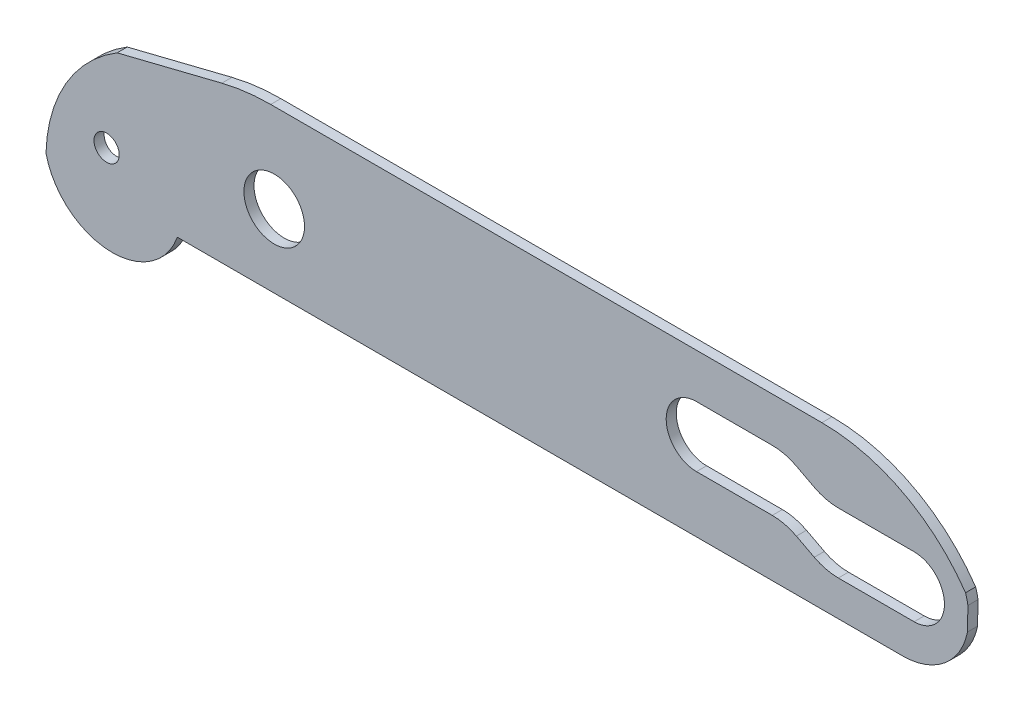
ISO-10303-21;
HEADER;
FILE_DESCRIPTION(('STEP AP214'),'2;1');
FILE_NAME('part.step','',(''),(''),'','','');
FILE_SCHEMA(('AUTOMOTIVE_DESIGN { 1 0 10303 214 1 1 1 1 }'));
ENDSEC;
DATA;
#1=APPLICATION_CONTEXT('core data for automotive mechanical design processes');
#2=APPLICATION_PROTOCOL_DEFINITION('international standard','automotive_design',2000,#1);
#3=PRODUCT_CONTEXT('',#1,'mechanical');
#4=PRODUCT('Part','Part','',(#3));
#5=PRODUCT_RELATED_PRODUCT_CATEGORY('part','',(#4));
#6=PRODUCT_DEFINITION_FORMATION('','',#4);
#7=PRODUCT_DEFINITION_CONTEXT('part definition',#1,'design');
#8=PRODUCT_DEFINITION('design','',#6,#7);
#9=PRODUCT_DEFINITION_SHAPE('','',#8);
#10=(LENGTH_UNIT() NAMED_UNIT(*) SI_UNIT(.MILLI.,.METRE.));
#11=(NAMED_UNIT(*) PLANE_ANGLE_UNIT() SI_UNIT($,.RADIAN.));
#12=(NAMED_UNIT(*) SI_UNIT($,.STERADIAN.) SOLID_ANGLE_UNIT());
#13=UNCERTAINTY_MEASURE_WITH_UNIT(LENGTH_MEASURE(1.E-05),#10,'distance_accuracy_value','');
#14=(GEOMETRIC_REPRESENTATION_CONTEXT(3) GLOBAL_UNCERTAINTY_ASSIGNED_CONTEXT((#13)) GLOBAL_UNIT_ASSIGNED_CONTEXT((#10,
#11,#12)) REPRESENTATION_CONTEXT('',''));
#15=CARTESIAN_POINT('',(0.,0.,0.));
#16=DIRECTION('',(0.,0.,1.));
#17=DIRECTION('',(1.,0.,0.));
#18=AXIS2_PLACEMENT_3D('',#15,#16,#17);
#19=CARTESIAN_POINT('',(-6.44003693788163,2.30657377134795,1.));
#20=DIRECTION('',(0.,0.,-1.));
#21=DIRECTION('',(-1.,0.,0.));
#22=AXIS2_PLACEMENT_3D('',#19,#20,#21);
#23=PLANE('',#22);
#24=DIRECTION('',(-1.,0.,0.));
#25=VECTOR('',#24,1.);
#26=CARTESIAN_POINT('',(72.9112737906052,9.5,1.));
#27=LINE('',#26,#25);
#28=CARTESIAN_POINT('',(72.9112737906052,9.5,1.));
#29=VERTEX_POINT('',#28);
#30=CARTESIAN_POINT('',(65.4112737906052,9.5,1.));
#31=VERTEX_POINT('',#30);
#32=EDGE_CURVE('E514',#29,#31,#27,.T.);
#33=ORIENTED_EDGE('',*,*,#32,.F.);
#34=CARTESIAN_POINT('',(72.9112737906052,6.5,1.));
#35=DIRECTION('',(0.,0.,1.));
#36=DIRECTION('',(-1.,0.,0.));
#37=AXIS2_PLACEMENT_3D('',#34,#35,#36);
#38=CIRCLE('',#37,3.);
#39=CARTESIAN_POINT('',(72.9112737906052,3.5,1.));
#40=VERTEX_POINT('',#39);
#41=EDGE_CURVE('E363',#40,#29,#38,.T.);
#42=ORIENTED_EDGE('',*,*,#41,.F.);
#43=DIRECTION('',(1.,0.,0.));
#44=VECTOR('',#43,1.);
#45=CARTESIAN_POINT('',(72.9112737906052,3.5,1.));
#46=LINE('',#45,#44);
#47=CARTESIAN_POINT('',(65.4112737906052,3.5,1.));
#48=VERTEX_POINT('',#47);
#49=EDGE_CURVE('E547',#48,#40,#46,.T.);
#50=ORIENTED_EDGE('',*,*,#49,.F.);
#51=CARTESIAN_POINT('',(65.4112737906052,8.64,1.));
#52=DIRECTION('',(0.,0.,1.));
#53=DIRECTION('',(-1.,0.,0.));
#54=AXIS2_PLACEMENT_3D('',#51,#52,#53);
#55=CIRCLE('',#54,5.14);
#56=CARTESIAN_POINT('',(63.0280034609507,4.08592242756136,1.));
#57=VERTEX_POINT('',#56);
#58=EDGE_CURVE('E544',#57,#48,#55,.T.);
#59=ORIENTED_EDGE('',*,*,#58,.F.);
#60=DIRECTION('',(0.886007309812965,-0.463671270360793,0.));
#61=VECTOR('',#60,1.);
#62=CARTESIAN_POINT('',(61.2559888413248,5.01326496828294,1.));
#63=LINE('',#62,#61);
#64=CARTESIAN_POINT('',(61.2559888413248,5.01326496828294,1.));
#65=VERTEX_POINT('',#64);
#66=EDGE_CURVE('E541',#65,#57,#63,.T.);
#67=ORIENTED_EDGE('',*,*,#66,.F.);
#68=CARTESIAN_POINT('',(58.8727185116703,0.459187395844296,1.));
#69=DIRECTION('',(0.,0.,-1.));
#70=DIRECTION('',(-1.,0.,0.));
#71=AXIS2_PLACEMENT_3D('',#68,#69,#70);
#72=CIRCLE('',#71,5.14);
#73=CARTESIAN_POINT('',(58.8727185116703,5.5991873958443,1.));
#74=VERTEX_POINT('',#73);
#75=EDGE_CURVE('E538',#74,#65,#72,.T.);
#76=ORIENTED_EDGE('',*,*,#75,.F.);
#77=DIRECTION('',(1.,0.,0.));
#78=VECTOR('',#77,1.);
#79=CARTESIAN_POINT('',(51.3727185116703,5.5991873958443,1.));
#80=LINE('',#79,#78);
#81=CARTESIAN_POINT('',(51.3727185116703,5.5991873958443,1.));
#82=VERTEX_POINT('',#81);
#83=EDGE_CURVE('E535',#82,#74,#80,.T.);
#84=ORIENTED_EDGE('',*,*,#83,.F.);
#85=CARTESIAN_POINT('',(51.3727185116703,8.5991873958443,1.));
#86=DIRECTION('',(0.,0.,1.));
#87=DIRECTION('',(-1.,0.,0.));
#88=AXIS2_PLACEMENT_3D('',#85,#86,#87);
#89=CIRCLE('',#88,3.);
#90=CARTESIAN_POINT('',(51.3727185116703,11.5991873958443,1.));
#91=VERTEX_POINT('',#90);
#92=EDGE_CURVE('E532',#91,#82,#89,.T.);
#93=ORIENTED_EDGE('',*,*,#92,.F.);
#94=DIRECTION('',(-1.,0.,0.));
#95=VECTOR('',#94,1.);
#96=CARTESIAN_POINT('',(58.8727185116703,11.5991873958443,1.));
#97=LINE('',#96,#95);
#98=CARTESIAN_POINT('',(58.8727185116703,11.5991873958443,1.));
#99=VERTEX_POINT('',#98);
#100=EDGE_CURVE('E529',#99,#91,#97,.T.);
#101=ORIENTED_EDGE('',*,*,#100,.F.);
#102=CARTESIAN_POINT('',(58.8727185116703,6.4591873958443,1.));
#103=DIRECTION('',(0.,0.,1.));
#104=DIRECTION('',(-1.,0.,0.));
#105=AXIS2_PLACEMENT_3D('',#102,#103,#104);
#106=CIRCLE('',#105,5.14);
#107=CARTESIAN_POINT('',(61.2559888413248,11.0132649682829,1.));
#108=VERTEX_POINT('',#107);
#109=EDGE_CURVE('E523',#108,#99,#106,.T.);
#110=ORIENTED_EDGE('',*,*,#109,.F.);
#111=DIRECTION('',(-0.886007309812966,0.463671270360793,0.));
#112=VECTOR('',#111,1.);
#113=CARTESIAN_POINT('',(61.2559888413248,11.0132649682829,1.));
#114=LINE('',#113,#112);
#115=CARTESIAN_POINT('',(63.0280034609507,10.0859224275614,1.));
#116=VERTEX_POINT('',#115);
#117=EDGE_CURVE('E521',#116,#108,#114,.T.);
#118=ORIENTED_EDGE('',*,*,#117,.F.);
#119=CARTESIAN_POINT('',(65.4112737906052,14.64,1.));
#120=DIRECTION('',(0.,0.,-1.));
#121=DIRECTION('',(1.,0.,0.));
#122=AXIS2_PLACEMENT_3D('',#119,#120,#121);
#123=CIRCLE('',#122,5.14);
#124=EDGE_CURVE('E505',#31,#116,#123,.T.);
#125=ORIENTED_EDGE('',*,*,#124,.F.);
#126=EDGE_LOOP('',(#33,#42,#50,#59,#67,#76,#84,#93,#101,#110,#118,#125));
#127=FACE_BOUND('',#126,.T.);
#128=CARTESIAN_POINT('',(9.58381950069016,7.21,1.));
#129=DIRECTION('',(0.,0.,1.));
#130=DIRECTION('',(1.,0.,0.));
#131=AXIS2_PLACEMENT_3D('',#128,#129,#130);
#132=CIRCLE('',#131,3.);
#133=CARTESIAN_POINT('',(12.5838195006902,7.21,1.));
#134=VERTEX_POINT('',#133);
#135=EDGE_CURVE('E612',#134,#134,#132,.T.);
#136=ORIENTED_EDGE('',*,*,#135,.F.);
#137=EDGE_LOOP('',(#136));
#138=FACE_BOUND('',#137,.T.);
#139=CARTESIAN_POINT('',(-6.44003693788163,2.30657377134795,1.));
#140=DIRECTION('',(0.,0.,1.));
#141=DIRECTION('',(-1.,0.,0.));
#142=AXIS2_PLACEMENT_3D('',#139,#140,#141);
#143=CIRCLE('',#142,6.84064019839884);
#144=CARTESIAN_POINT('',(-7.30705508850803,-4.47889878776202,1.));
#145=VERTEX_POINT('',#144);
#146=CARTESIAN_POINT('',(0.,0.,1.));
#147=VERTEX_POINT('',#146);
#148=EDGE_CURVE('E638',#145,#147,#143,.T.);
#149=ORIENTED_EDGE('',*,*,#148,.T.);
#150=DIRECTION('',(1.,0.,0.));
#151=VECTOR('',#150,1.);
#152=CARTESIAN_POINT('',(0.,0.,1.));
#153=LINE('',#152,#151);
#154=CARTESIAN_POINT('',(71.7838195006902,0.,1.));
#155=VERTEX_POINT('',#154);
#156=EDGE_CURVE('E641',#147,#155,#153,.T.);
#157=ORIENTED_EDGE('',*,*,#156,.T.);
#158=CARTESIAN_POINT('',(71.7838195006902,6.53,1.));
#159=DIRECTION('',(0.,0.,1.));
#160=DIRECTION('',(1.,0.,0.));
#161=AXIS2_PLACEMENT_3D('',#158,#159,#160);
#162=CIRCLE('',#161,6.53);
#163=CARTESIAN_POINT('',(78.1890777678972,5.25973761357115,1.));
#164=VERTEX_POINT('',#163);
#165=EDGE_CURVE('E643',#155,#164,#162,.T.);
#166=ORIENTED_EDGE('',*,*,#165,.T.);
#167=DIRECTION('',(0.0186351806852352,0.999826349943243,0.));
#168=VECTOR('',#167,1.);
#169=CARTESIAN_POINT('',(78.2319639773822,7.56069530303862,1.));
#170=LINE('',#169,#168);
#171=CARTESIAN_POINT('',(78.2319639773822,7.56069530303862,1.));
#172=VERTEX_POINT('',#171);
#173=EDGE_CURVE('E645',#164,#172,#170,.T.);
#174=ORIENTED_EDGE('',*,*,#173,.T.);
#175=CARTESIAN_POINT('',(71.7838195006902,6.53,1.));
#176=DIRECTION('',(0.,0.,1.));
#177=DIRECTION('',(1.,0.,0.));
#178=AXIS2_PLACEMENT_3D('',#175,#176,#177);
#179=CIRCLE('',#178,6.53);
#180=CARTESIAN_POINT('',(78.,8.53,1.));
#181=VERTEX_POINT('',#180);
#182=EDGE_CURVE('E647',#172,#181,#179,.T.);
#183=ORIENTED_EDGE('',*,*,#182,.T.);
#184=CARTESIAN_POINT('',(63.7838195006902,-1.26242891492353,1.));
#185=DIRECTION('',(0.,0.,1.));
#186=DIRECTION('',(-1.,0.,0.));
#187=AXIS2_PLACEMENT_3D('',#184,#185,#186);
#188=CIRCLE('',#187,17.2624289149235);
#189=CARTESIAN_POINT('',(63.7838195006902,16.,1.));
#190=VERTEX_POINT('',#189);
#191=EDGE_CURVE('E649',#181,#190,#188,.T.);
#192=ORIENTED_EDGE('',*,*,#191,.T.);
#193=DIRECTION('',(-1.,0.,0.));
#194=VECTOR('',#193,1.);
#195=CARTESIAN_POINT('',(9.23951071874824,16.,1.));
#196=LINE('',#195,#194);
#197=CARTESIAN_POINT('',(9.23951071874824,16.,1.));
#198=VERTEX_POINT('',#197);
#199=EDGE_CURVE('E651',#190,#198,#196,.T.);
#200=ORIENTED_EDGE('',*,*,#199,.T.);
#201=CARTESIAN_POINT('',(9.23951071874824,-4.,1.));
#202=DIRECTION('',(0.,0.,1.));
#203=DIRECTION('',(1.,0.,0.));
#204=AXIS2_PLACEMENT_3D('',#201,#202,#203);
#205=CIRCLE('',#204,20.);
#206=CARTESIAN_POINT('',(4.40107280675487,15.4059145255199,1.));
#207=VERTEX_POINT('',#206);
#208=EDGE_CURVE('E653',#198,#207,#205,.T.);
#209=ORIENTED_EDGE('',*,*,#208,.T.);
#210=DIRECTION('',(-0.970295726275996,-0.241921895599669,0.));
#211=VECTOR('',#210,1.);
#212=CARTESIAN_POINT('',(4.40107280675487,15.4059145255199,1.));
#213=LINE('',#212,#211);
#214=CARTESIAN_POINT('',(-5.95954577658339,12.8227221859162,1.));
#215=VERTEX_POINT('',#214);
#216=EDGE_CURVE('E655',#207,#215,#213,.T.);
#217=ORIENTED_EDGE('',*,*,#216,.T.);
#218=CARTESIAN_POINT('',(1.58074264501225,0.337599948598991,1.));
#219=DIRECTION('',(0.,0.,1.));
#220=DIRECTION('',(-1.,0.,0.));
#221=AXIS2_PLACEMENT_3D('',#218,#219,#220);
#222=CIRCLE('',#221,14.5854114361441);
#223=CARTESIAN_POINT('',(-13.,0.706613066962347,1.));
#224=VERTEX_POINT('',#223);
#225=EDGE_CURVE('E657',#215,#224,#222,.T.);
#226=ORIENTED_EDGE('',*,*,#225,.T.);
#227=CARTESIAN_POINT('',(-6.45725345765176,2.17183354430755,1.));
#228=DIRECTION('',(0.,0.,1.));
#229=DIRECTION('',(-1.,0.,0.));
#230=AXIS2_PLACEMENT_3D('',#227,#228,#229);
#231=CIRCLE('',#230,6.70480449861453);
#232=EDGE_CURVE('E659',#224,#145,#231,.T.);
#233=ORIENTED_EDGE('',*,*,#232,.T.);
#234=EDGE_LOOP('',(#149,#157,#166,#174,#183,#192,#200,#209,#217,#226,#233));
#235=FACE_BOUND('',#234,.T.);
#236=CARTESIAN_POINT('',(-7.,4.17,1.));
#237=DIRECTION('',(0.,0.,1.));
#238=DIRECTION('',(1.,0.,0.));
#239=AXIS2_PLACEMENT_3D('',#236,#237,#238);
#240=CIRCLE('',#239,1.25);
#241=CARTESIAN_POINT('',(-5.75,4.17,1.));
#242=VERTEX_POINT('',#241);
#243=EDGE_CURVE('E606',#242,#242,#240,.T.);
#244=ORIENTED_EDGE('',*,*,#243,.F.);
#245=EDGE_LOOP('',(#244));
#246=FACE_BOUND('',#245,.T.);
#247=ADVANCED_FACE('F348',(#127,#138,#235,#246),#23,.F.);
#248=CARTESIAN_POINT('',(-6.44003693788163,2.30657377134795,0.));
#249=DIRECTION('',(0.,0.,-1.));
#250=DIRECTION('',(-1.,0.,0.));
#251=AXIS2_PLACEMENT_3D('',#248,#249,#250);
#252=PLANE('',#251);
#253=CARTESIAN_POINT('',(72.9112737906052,6.5,0.));
#254=DIRECTION('',(0.,0.,1.));
#255=DIRECTION('',(-1.,0.,0.));
#256=AXIS2_PLACEMENT_3D('',#253,#254,#255);
#257=CIRCLE('',#256,3.);
#258=CARTESIAN_POINT('',(72.9112737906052,3.5,0.));
#259=VERTEX_POINT('',#258);
#260=CARTESIAN_POINT('',(72.9112737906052,9.5,0.));
#261=VERTEX_POINT('',#260);
#262=EDGE_CURVE('E550',#259,#261,#257,.T.);
#263=ORIENTED_EDGE('',*,*,#262,.T.);
#264=DIRECTION('',(-1.,0.,0.));
#265=VECTOR('',#264,1.);
#266=CARTESIAN_POINT('',(72.9112737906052,9.5,0.));
#267=LINE('',#266,#265);
#268=CARTESIAN_POINT('',(65.4112737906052,9.5,0.));
#269=VERTEX_POINT('',#268);
#270=EDGE_CURVE('E553',#261,#269,#267,.T.);
#271=ORIENTED_EDGE('',*,*,#270,.T.);
#272=CARTESIAN_POINT('',(65.4112737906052,14.64,0.));
#273=DIRECTION('',(0.,0.,-1.));
#274=DIRECTION('',(1.,0.,0.));
#275=AXIS2_PLACEMENT_3D('',#272,#273,#274);
#276=CIRCLE('',#275,5.14);
#277=CARTESIAN_POINT('',(63.0280034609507,10.0859224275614,0.));
#278=VERTEX_POINT('',#277);
#279=EDGE_CURVE('E371',#269,#278,#276,.T.);
#280=ORIENTED_EDGE('',*,*,#279,.T.);
#281=DIRECTION('',(-0.886007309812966,0.463671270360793,0.));
#282=VECTOR('',#281,1.);
#283=CARTESIAN_POINT('',(61.2559888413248,11.0132649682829,0.));
#284=LINE('',#283,#282);
#285=CARTESIAN_POINT('',(61.2559888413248,11.0132649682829,0.));
#286=VERTEX_POINT('',#285);
#287=EDGE_CURVE('E556',#278,#286,#284,.T.);
#288=ORIENTED_EDGE('',*,*,#287,.T.);
#289=CARTESIAN_POINT('',(58.8727185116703,6.4591873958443,0.));
#290=DIRECTION('',(0.,0.,1.));
#291=DIRECTION('',(-1.,0.,0.));
#292=AXIS2_PLACEMENT_3D('',#289,#290,#291);
#293=CIRCLE('',#292,5.14);
#294=CARTESIAN_POINT('',(58.8727185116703,11.5991873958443,0.));
#295=VERTEX_POINT('',#294);
#296=EDGE_CURVE('E559',#286,#295,#293,.T.);
#297=ORIENTED_EDGE('',*,*,#296,.T.);
#298=DIRECTION('',(-1.,0.,0.));
#299=VECTOR('',#298,1.);
#300=CARTESIAN_POINT('',(58.8727185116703,11.5991873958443,0.));
#301=LINE('',#300,#299);
#302=CARTESIAN_POINT('',(51.3727185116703,11.5991873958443,0.));
#303=VERTEX_POINT('',#302);
#304=EDGE_CURVE('E562',#295,#303,#301,.T.);
#305=ORIENTED_EDGE('',*,*,#304,.T.);
#306=CARTESIAN_POINT('',(51.3727185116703,8.5991873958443,0.));
#307=DIRECTION('',(0.,0.,1.));
#308=DIRECTION('',(-1.,0.,0.));
#309=AXIS2_PLACEMENT_3D('',#306,#307,#308);
#310=CIRCLE('',#309,3.);
#311=CARTESIAN_POINT('',(51.3727185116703,5.5991873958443,0.));
#312=VERTEX_POINT('',#311);
#313=EDGE_CURVE('E565',#303,#312,#310,.T.);
#314=ORIENTED_EDGE('',*,*,#313,.T.);
#315=DIRECTION('',(1.,0.,0.));
#316=VECTOR('',#315,1.);
#317=CARTESIAN_POINT('',(51.3727185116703,5.5991873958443,0.));
#318=LINE('',#317,#316);
#319=CARTESIAN_POINT('',(58.8727185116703,5.5991873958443,0.));
#320=VERTEX_POINT('',#319);
#321=EDGE_CURVE('E568',#312,#320,#318,.T.);
#322=ORIENTED_EDGE('',*,*,#321,.T.);
#323=CARTESIAN_POINT('',(58.8727185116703,0.459187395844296,0.));
#324=DIRECTION('',(0.,0.,-1.));
#325=DIRECTION('',(-1.,0.,0.));
#326=AXIS2_PLACEMENT_3D('',#323,#324,#325);
#327=CIRCLE('',#326,5.14);
#328=CARTESIAN_POINT('',(61.2559888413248,5.01326496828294,0.));
#329=VERTEX_POINT('',#328);
#330=EDGE_CURVE('E571',#320,#329,#327,.T.);
#331=ORIENTED_EDGE('',*,*,#330,.T.);
#332=DIRECTION('',(0.886007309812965,-0.463671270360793,0.));
#333=VECTOR('',#332,1.);
#334=CARTESIAN_POINT('',(61.2559888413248,5.01326496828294,0.));
#335=LINE('',#334,#333);
#336=CARTESIAN_POINT('',(63.0280034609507,4.08592242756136,0.));
#337=VERTEX_POINT('',#336);
#338=EDGE_CURVE('E574',#329,#337,#335,.T.);
#339=ORIENTED_EDGE('',*,*,#338,.T.);
#340=CARTESIAN_POINT('',(65.4112737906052,8.64,0.));
#341=DIRECTION('',(0.,0.,1.));
#342=DIRECTION('',(-1.,0.,0.));
#343=AXIS2_PLACEMENT_3D('',#340,#341,#342);
#344=CIRCLE('',#343,5.14);
#345=CARTESIAN_POINT('',(65.4112737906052,3.5,0.));
#346=VERTEX_POINT('',#345);
#347=EDGE_CURVE('E577',#337,#346,#344,.T.);
#348=ORIENTED_EDGE('',*,*,#347,.T.);
#349=DIRECTION('',(1.,0.,0.));
#350=VECTOR('',#349,1.);
#351=CARTESIAN_POINT('',(72.9112737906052,3.5,0.));
#352=LINE('',#351,#350);
#353=EDGE_CURVE('E580',#346,#259,#352,.T.);
#354=ORIENTED_EDGE('',*,*,#353,.T.);
#355=EDGE_LOOP('',(#263,#271,#280,#288,#297,#305,#314,#322,#331,#339,#348,#354));
#356=FACE_BOUND('',#355,.T.);
#357=CARTESIAN_POINT('',(9.58381950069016,7.21,0.));
#358=DIRECTION('',(0.,0.,1.));
#359=DIRECTION('',(1.,0.,0.));
#360=AXIS2_PLACEMENT_3D('',#357,#358,#359);
#361=CIRCLE('',#360,3.);
#362=CARTESIAN_POINT('',(12.5838195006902,7.21,0.));
#363=VERTEX_POINT('',#362);
#364=EDGE_CURVE('E609',#363,#363,#361,.T.);
#365=ORIENTED_EDGE('',*,*,#364,.T.);
#366=EDGE_LOOP('',(#365));
#367=FACE_BOUND('',#366,.T.);
#368=CARTESIAN_POINT('',(-6.44003693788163,2.30657377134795,0.));
#369=DIRECTION('',(0.,0.,1.));
#370=DIRECTION('',(-1.,0.,0.));
#371=AXIS2_PLACEMENT_3D('',#368,#369,#370);
#372=CIRCLE('',#371,6.84064019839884);
#373=CARTESIAN_POINT('',(-7.30705508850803,-4.47889878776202,0.));
#374=VERTEX_POINT('',#373);
#375=CARTESIAN_POINT('',(0.,0.,0.));
#376=VERTEX_POINT('',#375);
#377=EDGE_CURVE('E615',#374,#376,#372,.T.);
#378=ORIENTED_EDGE('',*,*,#377,.F.);
#379=CARTESIAN_POINT('',(-6.45725345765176,2.17183354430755,0.));
#380=DIRECTION('',(0.,0.,1.));
#381=DIRECTION('',(-1.,0.,0.));
#382=AXIS2_PLACEMENT_3D('',#379,#380,#381);
#383=CIRCLE('',#382,6.70480449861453);
#384=CARTESIAN_POINT('',(-13.,0.706613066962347,0.));
#385=VERTEX_POINT('',#384);
#386=EDGE_CURVE('E636',#385,#374,#383,.T.);
#387=ORIENTED_EDGE('',*,*,#386,.F.);
#388=CARTESIAN_POINT('',(1.58074264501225,0.337599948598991,0.));
#389=DIRECTION('',(0.,0.,1.));
#390=DIRECTION('',(-1.,0.,0.));
#391=AXIS2_PLACEMENT_3D('',#388,#389,#390);
#392=CIRCLE('',#391,14.5854114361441);
#393=CARTESIAN_POINT('',(-5.95954577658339,12.8227221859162,0.));
#394=VERTEX_POINT('',#393);
#395=EDGE_CURVE('E634',#394,#385,#392,.T.);
#396=ORIENTED_EDGE('',*,*,#395,.F.);
#397=DIRECTION('',(-0.970295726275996,-0.241921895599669,0.));
#398=VECTOR('',#397,1.);
#399=CARTESIAN_POINT('',(4.40107280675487,15.4059145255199,0.));
#400=LINE('',#399,#398);
#401=CARTESIAN_POINT('',(4.40107280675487,15.4059145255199,0.));
#402=VERTEX_POINT('',#401);
#403=EDGE_CURVE('E632',#402,#394,#400,.T.);
#404=ORIENTED_EDGE('',*,*,#403,.F.);
#405=CARTESIAN_POINT('',(9.23951071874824,-4.,0.));
#406=DIRECTION('',(0.,0.,1.));
#407=DIRECTION('',(1.,0.,0.));
#408=AXIS2_PLACEMENT_3D('',#405,#406,#407);
#409=CIRCLE('',#408,20.);
#410=CARTESIAN_POINT('',(9.23951071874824,16.,0.));
#411=VERTEX_POINT('',#410);
#412=EDGE_CURVE('E630',#411,#402,#409,.T.);
#413=ORIENTED_EDGE('',*,*,#412,.F.);
#414=DIRECTION('',(-1.,0.,0.));
#415=VECTOR('',#414,1.);
#416=CARTESIAN_POINT('',(9.23951071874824,16.,0.));
#417=LINE('',#416,#415);
#418=CARTESIAN_POINT('',(63.7838195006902,16.,0.));
#419=VERTEX_POINT('',#418);
#420=EDGE_CURVE('E628',#419,#411,#417,.T.);
#421=ORIENTED_EDGE('',*,*,#420,.F.);
#422=CARTESIAN_POINT('',(63.7838195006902,-1.26242891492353,0.));
#423=DIRECTION('',(0.,0.,1.));
#424=DIRECTION('',(-1.,0.,0.));
#425=AXIS2_PLACEMENT_3D('',#422,#423,#424);
#426=CIRCLE('',#425,17.2624289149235);
#427=CARTESIAN_POINT('',(78.,8.53,0.));
#428=VERTEX_POINT('',#427);
#429=EDGE_CURVE('E626',#428,#419,#426,.T.);
#430=ORIENTED_EDGE('',*,*,#429,.F.);
#431=CARTESIAN_POINT('',(71.7838195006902,6.53,0.));
#432=DIRECTION('',(0.,0.,1.));
#433=DIRECTION('',(1.,0.,0.));
#434=AXIS2_PLACEMENT_3D('',#431,#432,#433);
#435=CIRCLE('',#434,6.53);
#436=CARTESIAN_POINT('',(78.2319639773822,7.56069530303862,0.));
#437=VERTEX_POINT('',#436);
#438=EDGE_CURVE('E624',#437,#428,#435,.T.);
#439=ORIENTED_EDGE('',*,*,#438,.F.);
#440=DIRECTION('',(0.0186351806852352,0.999826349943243,0.));
#441=VECTOR('',#440,1.);
#442=CARTESIAN_POINT('',(78.2319639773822,7.56069530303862,0.));
#443=LINE('',#442,#441);
#444=CARTESIAN_POINT('',(78.1890777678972,5.25973761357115,0.));
#445=VERTEX_POINT('',#444);
#446=EDGE_CURVE('E622',#445,#437,#443,.T.);
#447=ORIENTED_EDGE('',*,*,#446,.F.);
#448=CARTESIAN_POINT('',(71.7838195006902,6.53,0.));
#449=DIRECTION('',(0.,0.,1.));
#450=DIRECTION('',(1.,0.,0.));
#451=AXIS2_PLACEMENT_3D('',#448,#449,#450);
#452=CIRCLE('',#451,6.53);
#453=CARTESIAN_POINT('',(71.7838195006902,0.,0.));
#454=VERTEX_POINT('',#453);
#455=EDGE_CURVE('E620',#454,#445,#452,.T.);
#456=ORIENTED_EDGE('',*,*,#455,.F.);
#457=DIRECTION('',(1.,0.,0.));
#458=VECTOR('',#457,1.);
#459=CARTESIAN_POINT('',(0.,0.,0.));
#460=LINE('',#459,#458);
#461=EDGE_CURVE('E618',#376,#454,#460,.T.);
#462=ORIENTED_EDGE('',*,*,#461,.F.);
#463=EDGE_LOOP('',(#378,#387,#396,#404,#413,#421,#430,#439,#447,#456,#462));
#464=FACE_BOUND('',#463,.T.);
#465=CARTESIAN_POINT('',(-7.,4.17,0.));
#466=DIRECTION('',(0.,0.,1.));
#467=DIRECTION('',(1.,0.,0.));
#468=AXIS2_PLACEMENT_3D('',#465,#466,#467);
#469=CIRCLE('',#468,1.25);
#470=CARTESIAN_POINT('',(-5.75,4.17,0.));
#471=VERTEX_POINT('',#470);
#472=EDGE_CURVE('E585',#471,#471,#469,.T.);
#473=ORIENTED_EDGE('',*,*,#472,.T.);
#474=EDGE_LOOP('',(#473));
#475=FACE_BOUND('',#474,.T.);
#476=ADVANCED_FACE('F698',(#356,#367,#464,#475),#252,.T.);
#477=CARTESIAN_POINT('',(-6.44003693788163,2.30657377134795,1.));
#478=DIRECTION('',(0.,0.,-1.));
#479=DIRECTION('',(-1.,0.,0.));
#480=AXIS2_PLACEMENT_3D('',#477,#478,#479);
#481=CYLINDRICAL_SURFACE('',#480,6.84064019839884);
#482=ORIENTED_EDGE('',*,*,#377,.T.);
#483=DIRECTION('',(0.,0.,-1.));
#484=VECTOR('',#483,1.);
#485=CARTESIAN_POINT('',(0.,0.,1.));
#486=LINE('',#485,#484);
#487=EDGE_CURVE('E11',#147,#376,#486,.T.);
#488=ORIENTED_EDGE('',*,*,#487,.F.);
#489=ORIENTED_EDGE('',*,*,#148,.F.);
#490=DIRECTION('',(0.,0.,-1.));
#491=VECTOR('',#490,1.);
#492=CARTESIAN_POINT('',(-7.30705508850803,-4.47889878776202,1.));
#493=LINE('',#492,#491);
#494=EDGE_CURVE('E661',#145,#374,#493,.T.);
#495=ORIENTED_EDGE('',*,*,#494,.T.);
#496=EDGE_LOOP('',(#482,#488,#489,#495));
#497=FACE_BOUND('',#496,.T.);
#498=ADVANCED_FACE('F350',(#497),#481,.T.);
#499=CARTESIAN_POINT('',(0.,0.,1.));
#500=DIRECTION('',(0.,1.,0.));
#501=DIRECTION('',(0.,0.,1.));
#502=AXIS2_PLACEMENT_3D('',#499,#500,#501);
#503=PLANE('',#502);
#504=ORIENTED_EDGE('',*,*,#461,.T.);
#505=DIRECTION('',(0.,0.,-1.));
#506=VECTOR('',#505,1.);
#507=CARTESIAN_POINT('',(71.7838195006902,0.,1.));
#508=LINE('',#507,#506);
#509=EDGE_CURVE('E356',#155,#454,#508,.T.);
#510=ORIENTED_EDGE('',*,*,#509,.F.);
#511=ORIENTED_EDGE('',*,*,#156,.F.);
#512=ORIENTED_EDGE('',*,*,#487,.T.);
#513=EDGE_LOOP('',(#504,#510,#511,#512));
#514=FACE_BOUND('',#513,.T.);
#515=ADVANCED_FACE('F716',(#514),#503,.F.);
#516=CARTESIAN_POINT('',(71.7838195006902,6.53,1.));
#517=DIRECTION('',(0.,0.,-1.));
#518=DIRECTION('',(-1.,0.,0.));
#519=AXIS2_PLACEMENT_3D('',#516,#517,#518);
#520=CYLINDRICAL_SURFACE('',#519,6.53);
#521=ORIENTED_EDGE('',*,*,#455,.T.);
#522=DIRECTION('',(0.,0.,-1.));
#523=VECTOR('',#522,1.);
#524=CARTESIAN_POINT('',(78.1890777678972,5.25973761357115,1.));
#525=LINE('',#524,#523);
#526=EDGE_CURVE('E685',#164,#445,#525,.T.);
#527=ORIENTED_EDGE('',*,*,#526,.F.);
#528=ORIENTED_EDGE('',*,*,#165,.F.);
#529=ORIENTED_EDGE('',*,*,#509,.T.);
#530=EDGE_LOOP('',(#521,#527,#528,#529));
#531=FACE_BOUND('',#530,.T.);
#532=ADVANCED_FACE('F692',(#531),#520,.T.);
#533=CARTESIAN_POINT('',(78.2319639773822,7.56069530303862,1.));
#534=DIRECTION('',(-0.999826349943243,0.0186351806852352,0.));
#535=DIRECTION('',(-0.0186351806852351,-0.999826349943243,0.));
#536=AXIS2_PLACEMENT_3D('',#533,#534,#535);
#537=PLANE('',#536);
#538=ORIENTED_EDGE('',*,*,#446,.T.);
#539=DIRECTION('',(0.,0.,-1.));
#540=VECTOR('',#539,1.);
#541=CARTESIAN_POINT('',(78.2319639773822,7.56069530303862,1.));
#542=LINE('',#541,#540);
#543=EDGE_CURVE('E682',#172,#437,#542,.T.);
#544=ORIENTED_EDGE('',*,*,#543,.F.);
#545=ORIENTED_EDGE('',*,*,#173,.F.);
#546=ORIENTED_EDGE('',*,*,#526,.T.);
#547=EDGE_LOOP('',(#538,#544,#545,#546));
#548=FACE_BOUND('',#547,.T.);
#549=ADVANCED_FACE('F704',(#548),#537,.F.);
#550=CARTESIAN_POINT('',(71.7838195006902,6.53,1.));
#551=DIRECTION('',(0.,0.,-1.));
#552=DIRECTION('',(-1.,0.,0.));
#553=AXIS2_PLACEMENT_3D('',#550,#551,#552);
#554=CYLINDRICAL_SURFACE('',#553,6.53);
#555=ORIENTED_EDGE('',*,*,#438,.T.);
#556=DIRECTION('',(0.,0.,-1.));
#557=VECTOR('',#556,1.);
#558=CARTESIAN_POINT('',(78.,8.53,1.));
#559=LINE('',#558,#557);
#560=EDGE_CURVE('E679',#181,#428,#559,.T.);
#561=ORIENTED_EDGE('',*,*,#560,.F.);
#562=ORIENTED_EDGE('',*,*,#182,.F.);
#563=ORIENTED_EDGE('',*,*,#543,.T.);
#564=EDGE_LOOP('',(#555,#561,#562,#563));
#565=FACE_BOUND('',#564,.T.);
#566=ADVANCED_FACE('F708',(#565),#554,.T.);
#567=CARTESIAN_POINT('',(63.7838195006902,-1.26242891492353,1.));
#568=DIRECTION('',(0.,0.,-1.));
#569=DIRECTION('',(-1.,0.,0.));
#570=AXIS2_PLACEMENT_3D('',#567,#568,#569);
#571=CYLINDRICAL_SURFACE('',#570,17.2624289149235);
#572=ORIENTED_EDGE('',*,*,#429,.T.);
#573=DIRECTION('',(0.,0.,-1.));
#574=VECTOR('',#573,1.);
#575=CARTESIAN_POINT('',(63.7838195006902,16.,1.));
#576=LINE('',#575,#574);
#577=EDGE_CURVE('E676',#190,#419,#576,.T.);
#578=ORIENTED_EDGE('',*,*,#577,.F.);
#579=ORIENTED_EDGE('',*,*,#191,.F.);
#580=ORIENTED_EDGE('',*,*,#560,.T.);
#581=EDGE_LOOP('',(#572,#578,#579,#580));
#582=FACE_BOUND('',#581,.T.);
#583=ADVANCED_FACE('F744',(#582),#571,.T.);
#584=CARTESIAN_POINT('',(9.23951071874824,16.,1.));
#585=DIRECTION('',(0.,-1.,0.));
#586=DIRECTION('',(0.,0.,-1.));
#587=AXIS2_PLACEMENT_3D('',#584,#585,#586);
#588=PLANE('',#587);
#589=ORIENTED_EDGE('',*,*,#420,.T.);
#590=DIRECTION('',(0.,0.,-1.));
#591=VECTOR('',#590,1.);
#592=CARTESIAN_POINT('',(9.23951071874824,16.,1.));
#593=LINE('',#592,#591);
#594=EDGE_CURVE('E673',#198,#411,#593,.T.);
#595=ORIENTED_EDGE('',*,*,#594,.F.);
#596=ORIENTED_EDGE('',*,*,#199,.F.);
#597=ORIENTED_EDGE('',*,*,#577,.T.);
#598=EDGE_LOOP('',(#589,#595,#596,#597));
#599=FACE_BOUND('',#598,.T.);
#600=ADVANCED_FACE('F742',(#599),#588,.F.);
#601=CARTESIAN_POINT('',(9.23951071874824,-4.,1.));
#602=DIRECTION('',(0.,0.,-1.));
#603=DIRECTION('',(-1.,0.,0.));
#604=AXIS2_PLACEMENT_3D('',#601,#602,#603);
#605=CYLINDRICAL_SURFACE('',#604,20.);
#606=ORIENTED_EDGE('',*,*,#412,.T.);
#607=DIRECTION('',(0.,0.,-1.));
#608=VECTOR('',#607,1.);
#609=CARTESIAN_POINT('',(4.40107280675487,15.4059145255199,1.));
#610=LINE('',#609,#608);
#611=EDGE_CURVE('E670',#207,#402,#610,.T.);
#612=ORIENTED_EDGE('',*,*,#611,.F.);
#613=ORIENTED_EDGE('',*,*,#208,.F.);
#614=ORIENTED_EDGE('',*,*,#594,.T.);
#615=EDGE_LOOP('',(#606,#612,#613,#614));
#616=FACE_BOUND('',#615,.T.);
#617=ADVANCED_FACE('F737',(#616),#605,.T.);
#618=CARTESIAN_POINT('',(4.40107280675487,15.4059145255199,1.));
#619=DIRECTION('',(0.241921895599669,-0.970295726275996,0.));
#620=DIRECTION('',(0.970295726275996,0.241921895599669,0.));
#621=AXIS2_PLACEMENT_3D('',#618,#619,#620);
#622=PLANE('',#621);
#623=ORIENTED_EDGE('',*,*,#403,.T.);
#624=DIRECTION('',(0.,0.,-1.));
#625=VECTOR('',#624,1.);
#626=CARTESIAN_POINT('',(-5.95954577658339,12.8227221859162,1.));
#627=LINE('',#626,#625);
#628=EDGE_CURVE('E667',#215,#394,#627,.T.);
#629=ORIENTED_EDGE('',*,*,#628,.F.);
#630=ORIENTED_EDGE('',*,*,#216,.F.);
#631=ORIENTED_EDGE('',*,*,#611,.T.);
#632=EDGE_LOOP('',(#623,#629,#630,#631));
#633=FACE_BOUND('',#632,.T.);
#634=ADVANCED_FACE('F732',(#633),#622,.F.);
#635=CARTESIAN_POINT('',(1.58074264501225,0.337599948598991,1.));
#636=DIRECTION('',(0.,0.,-1.));
#637=DIRECTION('',(-1.,0.,0.));
#638=AXIS2_PLACEMENT_3D('',#635,#636,#637);
#639=CYLINDRICAL_SURFACE('',#638,14.5854114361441);
#640=ORIENTED_EDGE('',*,*,#395,.T.);
#641=DIRECTION('',(0.,0.,-1.));
#642=VECTOR('',#641,1.);
#643=CARTESIAN_POINT('',(-13.,0.706613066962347,1.));
#644=LINE('',#643,#642);
#645=EDGE_CURVE('E664',#224,#385,#644,.T.);
#646=ORIENTED_EDGE('',*,*,#645,.F.);
#647=ORIENTED_EDGE('',*,*,#225,.F.);
#648=ORIENTED_EDGE('',*,*,#628,.T.);
#649=EDGE_LOOP('',(#640,#646,#647,#648));
#650=FACE_BOUND('',#649,.T.);
#651=ADVANCED_FACE('F728',(#650),#639,.T.);
#652=CARTESIAN_POINT('',(-6.45725345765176,2.17183354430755,1.));
#653=DIRECTION('',(0.,0.,-1.));
#654=DIRECTION('',(-1.,0.,0.));
#655=AXIS2_PLACEMENT_3D('',#652,#653,#654);
#656=CYLINDRICAL_SURFACE('',#655,6.70480449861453);
#657=ORIENTED_EDGE('',*,*,#386,.T.);
#658=ORIENTED_EDGE('',*,*,#494,.F.);
#659=ORIENTED_EDGE('',*,*,#232,.F.);
#660=ORIENTED_EDGE('',*,*,#645,.T.);
#661=EDGE_LOOP('',(#657,#658,#659,#660));
#662=FACE_BOUND('',#661,.T.);
#663=ADVANCED_FACE('F723',(#662),#656,.T.);
#664=CARTESIAN_POINT('',(9.58381950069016,7.21,1.));
#665=DIRECTION('',(0.,0.,-1.));
#666=DIRECTION('',(-1.,0.,0.));
#667=AXIS2_PLACEMENT_3D('',#664,#665,#666);
#668=CYLINDRICAL_SURFACE('',#667,3.);
#669=ORIENTED_EDGE('',*,*,#135,.T.);
#670=EDGE_LOOP('',(#669));
#671=FACE_BOUND('',#670,.T.);
#672=ORIENTED_EDGE('',*,*,#364,.F.);
#673=EDGE_LOOP('',(#672));
#674=FACE_BOUND('',#673,.T.);
#675=ADVANCED_FACE('F765',(#671,#674),#668,.F.);
#676=CARTESIAN_POINT('',(-7.,4.17,1.));
#677=DIRECTION('',(0.,0.,-1.));
#678=DIRECTION('',(-1.,0.,0.));
#679=AXIS2_PLACEMENT_3D('',#676,#677,#678);
#680=CYLINDRICAL_SURFACE('',#679,1.25);
#681=ORIENTED_EDGE('',*,*,#243,.T.);
#682=EDGE_LOOP('',(#681));
#683=FACE_BOUND('',#682,.T.);
#684=ORIENTED_EDGE('',*,*,#472,.F.);
#685=EDGE_LOOP('',(#684));
#686=FACE_BOUND('',#685,.T.);
#687=ADVANCED_FACE('F792',(#683,#686),#680,.F.);
#688=CARTESIAN_POINT('',(72.9112737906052,6.5,0.));
#689=DIRECTION('',(0.,0.,1.));
#690=DIRECTION('',(1.,0.,0.));
#691=AXIS2_PLACEMENT_3D('',#688,#689,#690);
#692=CYLINDRICAL_SURFACE('',#691,3.);
#693=ORIENTED_EDGE('',*,*,#41,.T.);
#694=DIRECTION('',(0.,0.,1.));
#695=VECTOR('',#694,1.);
#696=CARTESIAN_POINT('',(72.9112737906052,9.5,0.));
#697=LINE('',#696,#695);
#698=EDGE_CURVE('E511',#261,#29,#697,.T.);
#699=ORIENTED_EDGE('',*,*,#698,.F.);
#700=ORIENTED_EDGE('',*,*,#262,.F.);
#701=DIRECTION('',(0.,0.,1.));
#702=VECTOR('',#701,1.);
#703=CARTESIAN_POINT('',(72.9112737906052,3.5,0.));
#704=LINE('',#703,#702);
#705=EDGE_CURVE('E583',#259,#40,#704,.T.);
#706=ORIENTED_EDGE('',*,*,#705,.T.);
#707=EDGE_LOOP('',(#693,#699,#700,#706));
#708=FACE_BOUND('',#707,.T.);
#709=ADVANCED_FACE('F798',(#708),#692,.F.);
#710=CARTESIAN_POINT('',(72.9112737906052,3.5,0.));
#711=DIRECTION('',(0.,-1.,0.));
#712=DIRECTION('',(1.,0.,0.));
#713=AXIS2_PLACEMENT_3D('',#710,#711,#712);
#714=PLANE('',#713);
#715=ORIENTED_EDGE('',*,*,#49,.T.);
#716=ORIENTED_EDGE('',*,*,#705,.F.);
#717=ORIENTED_EDGE('',*,*,#353,.F.);
#718=DIRECTION('',(0.,0.,1.));
#719=VECTOR('',#718,1.);
#720=CARTESIAN_POINT('',(65.4112737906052,3.5,0.));
#721=LINE('',#720,#719);
#722=EDGE_CURVE('E586',#346,#48,#721,.T.);
#723=ORIENTED_EDGE('',*,*,#722,.T.);
#724=EDGE_LOOP('',(#715,#716,#717,#723));
#725=FACE_BOUND('',#724,.T.);
#726=ADVANCED_FACE('F808',(#725),#714,.F.);
#727=CARTESIAN_POINT('',(65.4112737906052,8.64,0.));
#728=DIRECTION('',(0.,0.,1.));
#729=DIRECTION('',(1.,0.,0.));
#730=AXIS2_PLACEMENT_3D('',#727,#728,#729);
#731=CYLINDRICAL_SURFACE('',#730,5.14);
#732=ORIENTED_EDGE('',*,*,#58,.T.);
#733=ORIENTED_EDGE('',*,*,#722,.F.);
#734=ORIENTED_EDGE('',*,*,#347,.F.);
#735=DIRECTION('',(0.,0.,1.));
#736=VECTOR('',#735,1.);
#737=CARTESIAN_POINT('',(63.0280034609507,4.08592242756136,0.));
#738=LINE('',#737,#736);
#739=EDGE_CURVE('E588',#337,#57,#738,.T.);
#740=ORIENTED_EDGE('',*,*,#739,.T.);
#741=EDGE_LOOP('',(#732,#733,#734,#740));
#742=FACE_BOUND('',#741,.T.);
#743=ADVANCED_FACE('F815',(#742),#731,.F.);
#744=CARTESIAN_POINT('',(61.2559888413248,5.01326496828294,0.));
#745=DIRECTION('',(-0.463671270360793,-0.886007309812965,0.));
#746=DIRECTION('',(0.886007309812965,-0.463671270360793,0.));
#747=AXIS2_PLACEMENT_3D('',#744,#745,#746);
#748=PLANE('',#747);
#749=ORIENTED_EDGE('',*,*,#66,.T.);
#750=ORIENTED_EDGE('',*,*,#739,.F.);
#751=ORIENTED_EDGE('',*,*,#338,.F.);
#752=DIRECTION('',(0.,0.,1.));
#753=VECTOR('',#752,1.);
#754=CARTESIAN_POINT('',(61.2559888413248,5.01326496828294,0.));
#755=LINE('',#754,#753);
#756=EDGE_CURVE('E590',#329,#65,#755,.T.);
#757=ORIENTED_EDGE('',*,*,#756,.T.);
#758=EDGE_LOOP('',(#749,#750,#751,#757));
#759=FACE_BOUND('',#758,.T.);
#760=ADVANCED_FACE('F823',(#759),#748,.F.);
#761=CARTESIAN_POINT('',(58.8727185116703,0.459187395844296,0.));
#762=DIRECTION('',(0.,0.,1.));
#763=DIRECTION('',(1.,0.,0.));
#764=AXIS2_PLACEMENT_3D('',#761,#762,#763);
#765=CYLINDRICAL_SURFACE('',#764,5.14);
#766=ORIENTED_EDGE('',*,*,#75,.T.);
#767=ORIENTED_EDGE('',*,*,#756,.F.);
#768=ORIENTED_EDGE('',*,*,#330,.F.);
#769=DIRECTION('',(0.,0.,1.));
#770=VECTOR('',#769,1.);
#771=CARTESIAN_POINT('',(58.8727185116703,5.5991873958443,0.));
#772=LINE('',#771,#770);
#773=EDGE_CURVE('E592',#320,#74,#772,.T.);
#774=ORIENTED_EDGE('',*,*,#773,.T.);
#775=EDGE_LOOP('',(#766,#767,#768,#774));
#776=FACE_BOUND('',#775,.T.);
#777=ADVANCED_FACE('F831',(#776),#765,.T.);
#778=CARTESIAN_POINT('',(51.3727185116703,5.5991873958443,0.));
#779=DIRECTION('',(0.,-1.,0.));
#780=DIRECTION('',(0.,0.,-1.));
#781=AXIS2_PLACEMENT_3D('',#778,#779,#780);
#782=PLANE('',#781);
#783=ORIENTED_EDGE('',*,*,#83,.T.);
#784=ORIENTED_EDGE('',*,*,#773,.F.);
#785=ORIENTED_EDGE('',*,*,#321,.F.);
#786=DIRECTION('',(0.,0.,1.));
#787=VECTOR('',#786,1.);
#788=CARTESIAN_POINT('',(51.3727185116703,5.5991873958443,0.));
#789=LINE('',#788,#787);
#790=EDGE_CURVE('E594',#312,#82,#789,.T.);
#791=ORIENTED_EDGE('',*,*,#790,.T.);
#792=EDGE_LOOP('',(#783,#784,#785,#791));
#793=FACE_BOUND('',#792,.T.);
#794=ADVANCED_FACE('F839',(#793),#782,.F.);
#795=CARTESIAN_POINT('',(51.3727185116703,8.5991873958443,0.));
#796=DIRECTION('',(0.,0.,1.));
#797=DIRECTION('',(1.,0.,0.));
#798=AXIS2_PLACEMENT_3D('',#795,#796,#797);
#799=CYLINDRICAL_SURFACE('',#798,3.);
#800=ORIENTED_EDGE('',*,*,#92,.T.);
#801=ORIENTED_EDGE('',*,*,#790,.F.);
#802=ORIENTED_EDGE('',*,*,#313,.F.);
#803=DIRECTION('',(0.,0.,1.));
#804=VECTOR('',#803,1.);
#805=CARTESIAN_POINT('',(51.3727185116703,11.5991873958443,0.));
#806=LINE('',#805,#804);
#807=EDGE_CURVE('E596',#303,#91,#806,.T.);
#808=ORIENTED_EDGE('',*,*,#807,.T.);
#809=EDGE_LOOP('',(#800,#801,#802,#808));
#810=FACE_BOUND('',#809,.T.);
#811=ADVANCED_FACE('F847',(#810),#799,.F.);
#812=CARTESIAN_POINT('',(58.8727185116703,11.5991873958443,0.));
#813=DIRECTION('',(0.,1.,0.));
#814=DIRECTION('',(-1.,0.,0.));
#815=AXIS2_PLACEMENT_3D('',#812,#813,#814);
#816=PLANE('',#815);
#817=ORIENTED_EDGE('',*,*,#100,.T.);
#818=ORIENTED_EDGE('',*,*,#807,.F.);
#819=ORIENTED_EDGE('',*,*,#304,.F.);
#820=DIRECTION('',(0.,0.,1.));
#821=VECTOR('',#820,1.);
#822=CARTESIAN_POINT('',(58.8727185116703,11.5991873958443,0.));
#823=LINE('',#822,#821);
#824=EDGE_CURVE('E598',#295,#99,#823,.T.);
#825=ORIENTED_EDGE('',*,*,#824,.T.);
#826=EDGE_LOOP('',(#817,#818,#819,#825));
#827=FACE_BOUND('',#826,.T.);
#828=ADVANCED_FACE('F855',(#827),#816,.F.);
#829=CARTESIAN_POINT('',(58.8727185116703,6.4591873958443,0.));
#830=DIRECTION('',(0.,0.,1.));
#831=DIRECTION('',(1.,0.,0.));
#832=AXIS2_PLACEMENT_3D('',#829,#830,#831);
#833=CYLINDRICAL_SURFACE('',#832,5.14);
#834=ORIENTED_EDGE('',*,*,#109,.T.);
#835=ORIENTED_EDGE('',*,*,#824,.F.);
#836=ORIENTED_EDGE('',*,*,#296,.F.);
#837=DIRECTION('',(0.,0.,1.));
#838=VECTOR('',#837,1.);
#839=CARTESIAN_POINT('',(61.2559888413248,11.0132649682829,0.));
#840=LINE('',#839,#838);
#841=EDGE_CURVE('E600',#286,#108,#840,.T.);
#842=ORIENTED_EDGE('',*,*,#841,.T.);
#843=EDGE_LOOP('',(#834,#835,#836,#842));
#844=FACE_BOUND('',#843,.T.);
#845=ADVANCED_FACE('F863',(#844),#833,.F.);
#846=CARTESIAN_POINT('',(61.2559888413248,11.0132649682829,0.));
#847=DIRECTION('',(0.463671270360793,0.886007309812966,0.));
#848=DIRECTION('',(-0.886007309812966,0.463671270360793,0.));
#849=AXIS2_PLACEMENT_3D('',#846,#847,#848);
#850=PLANE('',#849);
#851=ORIENTED_EDGE('',*,*,#117,.T.);
#852=ORIENTED_EDGE('',*,*,#841,.F.);
#853=ORIENTED_EDGE('',*,*,#287,.F.);
#854=DIRECTION('',(0.,0.,1.));
#855=VECTOR('',#854,1.);
#856=CARTESIAN_POINT('',(63.0280034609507,10.0859224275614,0.));
#857=LINE('',#856,#855);
#858=EDGE_CURVE('E510',#278,#116,#857,.T.);
#859=ORIENTED_EDGE('',*,*,#858,.T.);
#860=EDGE_LOOP('',(#851,#852,#853,#859));
#861=FACE_BOUND('',#860,.T.);
#862=ADVANCED_FACE('F871',(#861),#850,.F.);
#863=CARTESIAN_POINT('',(65.4112737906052,14.64,0.));
#864=DIRECTION('',(0.,0.,1.));
#865=DIRECTION('',(1.,0.,0.));
#866=AXIS2_PLACEMENT_3D('',#863,#864,#865);
#867=CYLINDRICAL_SURFACE('',#866,5.14);
#868=ORIENTED_EDGE('',*,*,#124,.T.);
#869=ORIENTED_EDGE('',*,*,#858,.F.);
#870=ORIENTED_EDGE('',*,*,#279,.F.);
#871=DIRECTION('',(0.,0.,1.));
#872=VECTOR('',#871,1.);
#873=CARTESIAN_POINT('',(65.4112737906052,9.5,0.));
#874=LINE('',#873,#872);
#875=EDGE_CURVE('E501',#269,#31,#874,.T.);
#876=ORIENTED_EDGE('',*,*,#875,.T.);
#877=EDGE_LOOP('',(#868,#869,#870,#876));
#878=FACE_BOUND('',#877,.T.);
#879=ADVANCED_FACE('F503',(#878),#867,.T.);
#880=CARTESIAN_POINT('',(72.9112737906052,9.5,0.));
#881=DIRECTION('',(0.,1.,0.));
#882=DIRECTION('',(-1.,0.,0.));
#883=AXIS2_PLACEMENT_3D('',#880,#881,#882);
#884=PLANE('',#883);
#885=ORIENTED_EDGE('',*,*,#32,.T.);
#886=ORIENTED_EDGE('',*,*,#875,.F.);
#887=ORIENTED_EDGE('',*,*,#270,.F.);
#888=ORIENTED_EDGE('',*,*,#698,.T.);
#889=EDGE_LOOP('',(#885,#886,#887,#888));
#890=FACE_BOUND('',#889,.T.);
#891=ADVANCED_FACE('F515',(#890),#884,.F.);
#892=CLOSED_SHELL('',(#247,#476,#498,#515,#532,#549,#566,#583,#600,#617,#634,#651,#663,#675,
#687,#709,#726,#743,#760,#777,#794,#811,#828,#845,#862,#879,#891));
#893=MANIFOLD_SOLID_BREP('B2',#892);
#894=ADVANCED_BREP_SHAPE_REPRESENTATION('',(#18,#893),#14);
#895=SHAPE_DEFINITION_REPRESENTATION(#9,#894);
ENDSEC;
END-ISO-10303-21;
